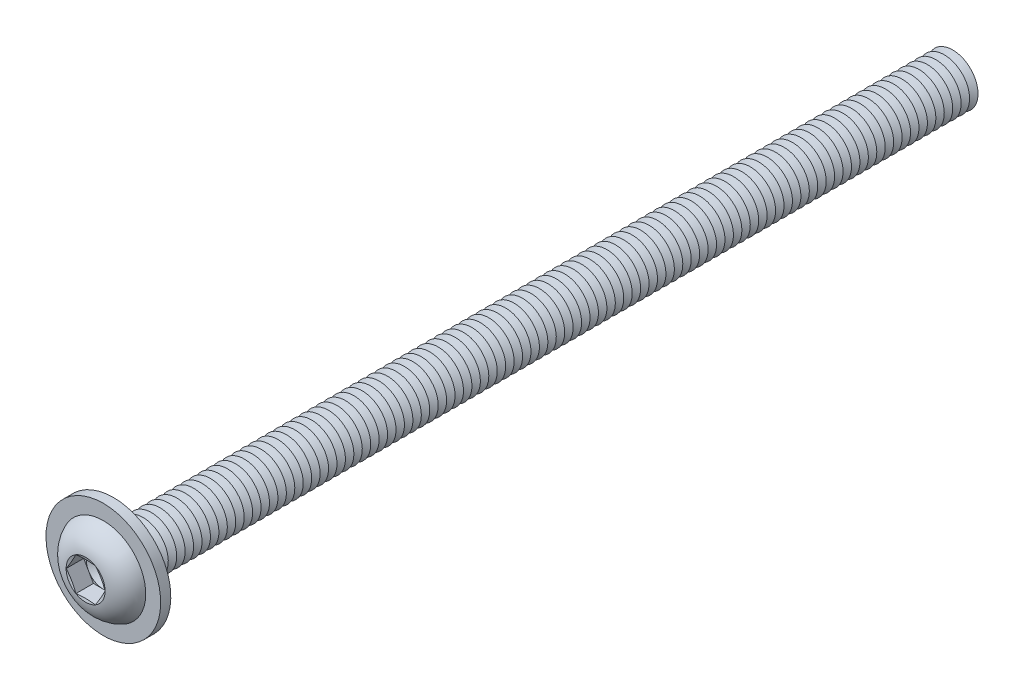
from build123d import *

# Parameters (mm, degrees)
FILLET1_R           = 0.5
LPATTERN1_COUNT     = 100
LPATTERN1_PITCH     = 1
CUT_EXTRUDE1_DEPTH  = 2.08
SKETCH5_R           = 6.8
SKETCH5_R_2         = 3.5
BOSS_EXTRUDE1_DEPTH = 1.2


with BuildPart() as part:
    # Sketch1 → Revolve1 (revolve)
    with BuildSketch(Plane(origin=(0, 0, 0), x_dir=(0, 0, -1), z_dir=(1, 0, 0))):
        with BuildLine():
            Line((0, 3), (0, 5.25))
            ThreePointArc((0, 5.25), (-2.210041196, 4.408189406), (-3.3, 2.3094))
            Line((-3.3, 2.3094), (-2.990599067, 1.1547))
            Line((-2.990599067, 1.1547), (-3.3, 1.1547))
            Line((-3.3, 1.1547), (-3.3, 0))
            Line((-3.3, 0), (100, 0))
            Line((100, 0), (100, 3))
            Line((100, 3), (0, 3))
        make_face()
    revolve(axis=Axis((0, 0, -100), (0, 0, 1)))

    # Fillet1
    fillet1_edges = [part.edges().sort_by_distance(p)[0] for p in [
        (0, -3, 0),
    ]]
    fillet(fillet1_edges, radius=FILLET1_R)

    # Sketch2 → Cut-Revolve1 (revolve, cut)
    with BuildSketch(Plane(origin=(0, 0, 0), x_dir=(0, 0, -1), z_dir=(1, 0, 0))):
        Polygon((99.5, 3), (100.5, 3), (100, 2.133974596), align=None)
    cut_revolve1 = revolve(axis=Axis((0, 0, -100), (0, 0, -1)), mode=Mode.SUBTRACT)

    # LPattern1: Cut-Revolve1 ×100
    with Locations(*[(0, 0, i * LPATTERN1_PITCH) for i in range(1, LPATTERN1_COUNT)]):
        add(cut_revolve1, mode=Mode.SUBTRACT)

    # Sketch3 → Cut-Extrude1 (cut)
    with BuildSketch(Plane.XY.offset(3.3)):
        Polygon((1.1547, 1.999999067), (-1.1547, 1.999999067), (-2.3094, 0), (-1.1547, -1.999999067), (1.1547, -1.999999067), (2.3094, 0), align=None)
    extrude(amount=-CUT_EXTRUDE1_DEPTH, mode=Mode.SUBTRACT)

    # Cut-Extrude2 cone 1 section (on through the dimple's axis) → Cut-Extrude2 (revolve, cut)
    with BuildSketch(Plane(origin=(0, 0, 1.22), x_dir=(0, -1, 0), z_dir=(1, 0, 0))):
        Polygon((0, 0), (1.999999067, 0), (0, 1.1547), align=None)
    revolve(axis=Axis((0, 0, 1.22), (0, 0, -1)), mode=Mode.SUBTRACT)

    # Sketch5 → Boss-Extrude1 (add)
    with BuildSketch(Plane(origin=(0, 0, 0), x_dir=(-1, 0, 0), z_dir=(0, 0, -1))):
        with Locations(Location((0, 0, 0), (0, 0, 90))):
            Circle(SKETCH5_R)
        Circle(SKETCH5_R_2, mode=Mode.SUBTRACT)
    extrude(amount=-BOSS_EXTRUDE1_DEPTH)


solid = part.part
